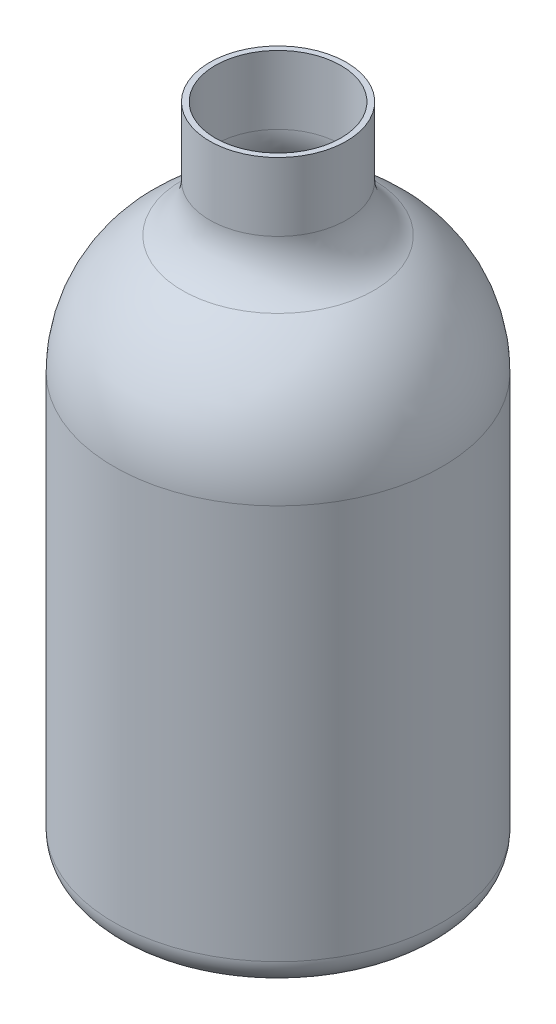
from build123d import *

# Parameters (mm, degrees)
SHELL1_T = -2


with BuildPart() as part:
    # Sketch1 → Revolve1 (revolve)
    with BuildSketch(Plane.XY, mode=Mode.PRIVATE) as revolve1_sk:
        with BuildLine():
            Line((0, 0), (50, 0))
            ThreePointArc((50, 0), (57.071067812, 2.928932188), (60, 10))
            Line((60, 10), (60, 154.378221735))
            ThreePointArc((60, 154.378221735), (53.301270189, 179.378221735), (35, 197.679491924))
            ThreePointArc((35, 197.679491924), (27.679491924, 205), (25, 215))
            Line((25, 215), (25, 240))
            Line((25, 240), (0, 240))
            Line((0, 240), (0, 0))
        make_face()
    revolve(revolve1_sk.sketch.rotate(Axis((0, 0, 0), (0, 1, 0)), 90), axis=Axis((0, 0, 0), (0, 1, 0)))

    # Shell1
    shell1_openings = [part.faces().sort_by_distance(p)[0] for p in [
        (0, 240, 0),
    ]]
    offset(amount=SHELL1_T, openings=shell1_openings, kind=Kind.INTERSECTION)


solid = part.part
